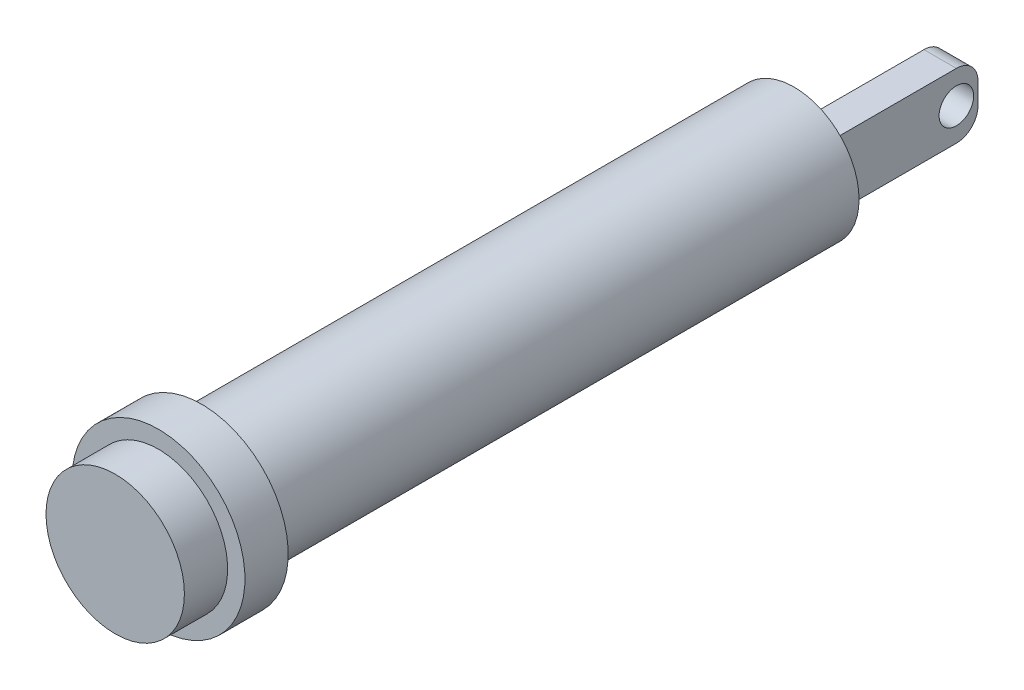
from build123d import *

# Parameters (mm, degrees)
SKETCH1_W            = 500
SKETCH1_H            = 75
SKETCH10_W           = 75
SKETCH10_H           = 75
BOSS_EXTRUDE7_DEPTH  = 175
SKETCH11_W           = 37.5
SKETCH11_H           = 75
CUT_EXTRUDE1_DEPTH   = 175
FILLET1_R            = 25
SKETCH12_R           = 20
CUT_EXTRUDE2_DEPTH   = 150
BOSS_EXTRUDE8_START  = 235
SKETCH13_R           = 75
BOSS_EXTRUDE8_DEPTH  = 235
SKETCH14_R           = 80
BOSS_EXTRUDE9_DEPTH  = 50
SKETCH15_R           = 100
BOSS_EXTRUDE10_DEPTH = 50


with BuildPart() as part:
    # Sketch1 → Revolve1 (revolve)
    with BuildSketch(Plane(origin=(0, 0, 0), x_dir=(0, 0, -1), z_dir=(1, 0, 0)), mode=Mode.PRIVATE) as revolve1_sk:
        with Locations((250, 37.5)):
            Rectangle(SKETCH1_W, SKETCH1_H)
    revolve(revolve1_sk.sketch.rotate(Axis((0, 0, 0), (0, 0, -1)), 90), axis=Axis((0, 0, 0), (0, 0, -1)))

    # Sketch10 → Boss-Extrude7 (add)
    with BuildSketch(Plane(origin=(0, 0, -500), x_dir=(-1, 0, 0), z_dir=(0, 0, -1))):
        Rectangle(SKETCH10_W, SKETCH10_H)
    extrude(amount=BOSS_EXTRUDE7_DEPTH)

    # Sketch11 → Cut-Extrude1 (cut)
    with BuildSketch(Plane(origin=(0, 0, -675), x_dir=(-1, 0, 0), z_dir=(0, 0, -1))):
        with Locations((18.75, 0)):
            Rectangle(SKETCH11_W, SKETCH11_H)
    extrude(amount=-CUT_EXTRUDE1_DEPTH, mode=Mode.SUBTRACT)

    # Fillet1
    fillet1_edges = [part.edges().sort_by_distance(p)[0] for p in [
        (18.75, -37.5, -675),
        (18.75, 37.5, -675),
    ]]
    fillet(fillet1_edges, radius=FILLET1_R)

    # Sketch12 → Cut-Extrude2 (cut)
    with BuildSketch(Plane(origin=(37.5, 0, 0), x_dir=(0, 0, -1), z_dir=(1, 0, 0))):
        with Locations((650, 0)):
            Circle(SKETCH12_R)
    extrude(amount=-CUT_EXTRUDE2_DEPTH, mode=Mode.SUBTRACT)

    # Sketch13 → Boss-Extrude8 (add)
    with BuildSketch(Plane.XY.offset(BOSS_EXTRUDE8_START)):
        Circle(SKETCH13_R)
    extrude(amount=-BOSS_EXTRUDE8_DEPTH)

    # Sketch14 → Boss-Extrude9 (add)
    with BuildSketch(Plane.XY.offset(235)):
        Circle(SKETCH14_R)
    extrude(amount=BOSS_EXTRUDE9_DEPTH)

    # Sketch15 → Boss-Extrude10 (add)
    with BuildSketch(Plane(origin=(0, 0, 235), x_dir=(-1, 0, 0), z_dir=(0, 0, -1))):
        Circle(SKETCH15_R)
    extrude(amount=BOSS_EXTRUDE10_DEPTH)


solid = part.part
